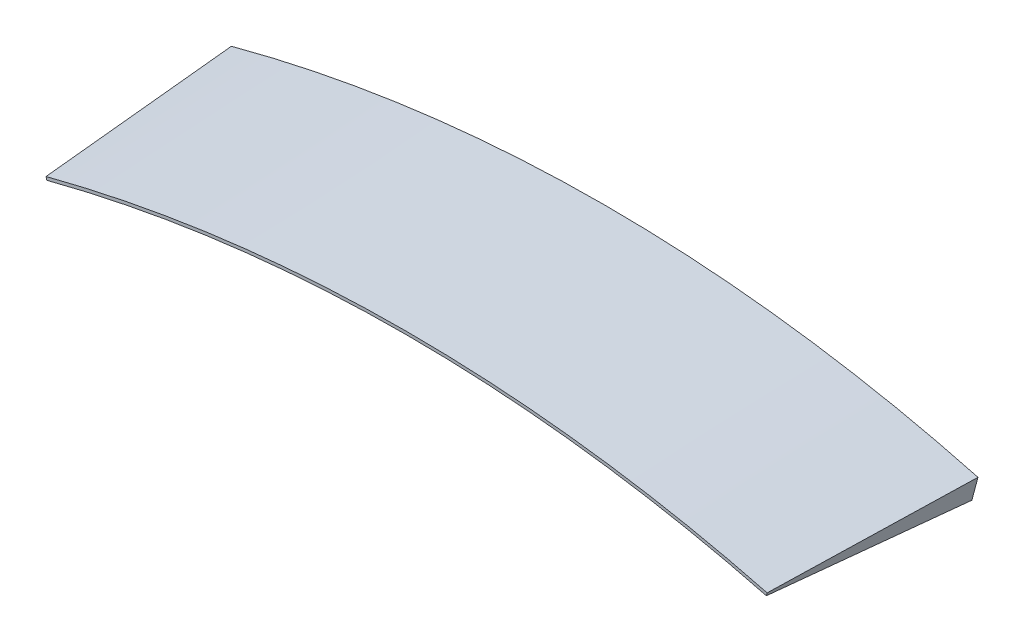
from build123d import *

# Parameters (mm, degrees)
EXTRU_MINCE1_DEPTH = 25
EXTRU_MINCE1_DRAFT = 3


with BuildPart() as part:
    # Esquisse1 → Extru.-Mince1 (with draft: the straight prism first)
    with BuildSketch(Plane.XY):
        with BuildLine():
            Line((-47.105066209, 175.798500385), (-46.328609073, 172.900722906))
            ThreePointArc((-46.328609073, 172.900722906), (0, 179), (46.328609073, 172.900722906))
            Line((46.328609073, 172.900722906), (47.105066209, 175.798500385))
            ThreePointArc((47.105066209, 175.798500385), (0, 182), (-47.105066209, 175.798500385))
        make_face()
    extrude(amount=EXTRU_MINCE1_DEPTH)
    # Extru.-Mince1: the draft: its side faces are tilted about the plane it starts from
    extru_mince1_sides = [part.faces().sort_by_distance(p)[0] for p in [
        (-46.716837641, 174.349611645, 12.5),
        (0, 179, 12.5),
        (46.716837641, 174.349611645, 12.5),
        (0, 182, 12.5),
    ]]
    draft(extru_mince1_sides, Plane.XY, EXTRU_MINCE1_DRAFT)


solid = part.part
